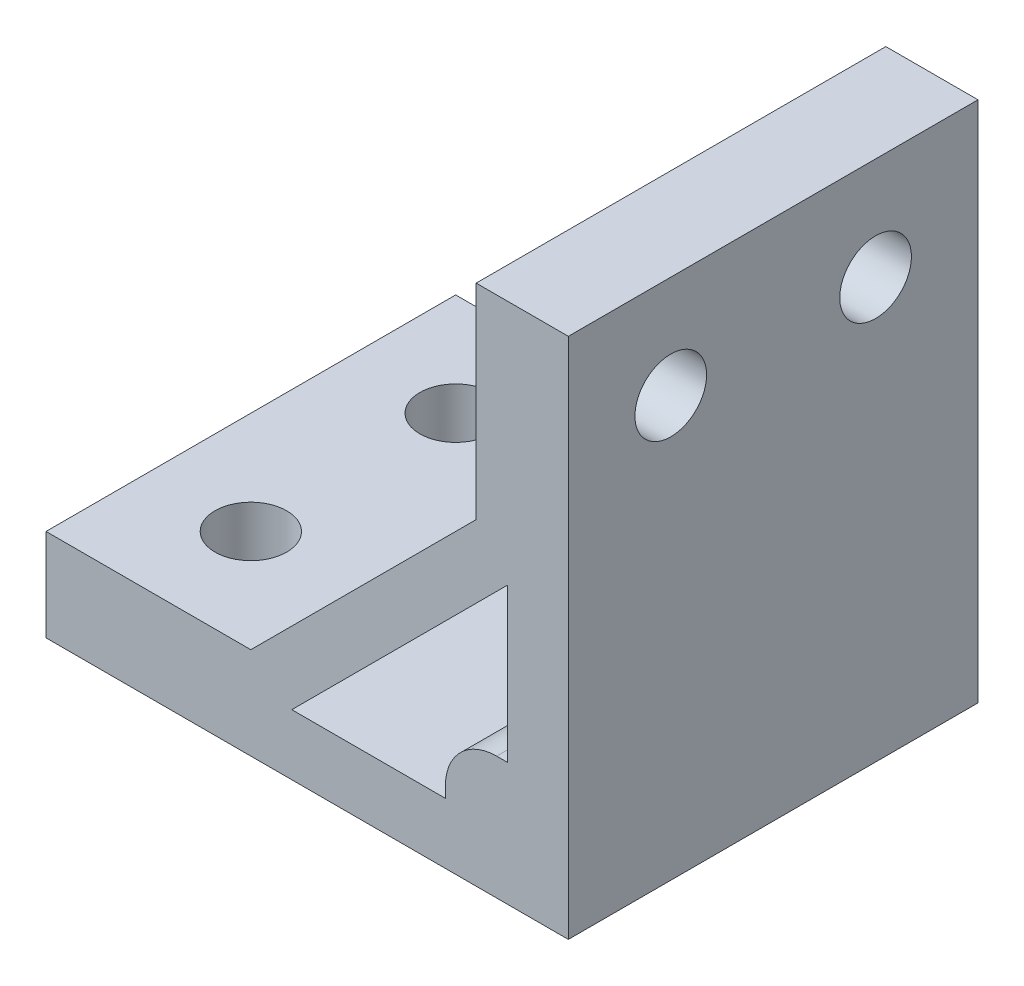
from build123d import *

# Parameters (mm, degrees)
EXTRUDE_1_DEPTH     = 40
FILLET_1_R          = 5
SKETCH_3_R          = 3.5
CUT_EXTRUDE_1_DEPTH = 40
SKETCH_4_R          = 3.5
CUT_EXTRUDE_2_DEPTH = 40


with BuildPart() as part:
    # Sketch 1 → Extrude 1 (new body)
    with BuildSketch(Plane.XY):
        Polygon((0, 0), (0, 51), (-9, 51), (-9, 31), (-31, 9), (-51, 9), (-51, 0), align=None)
        Polygon((-5.928932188, 27), (-27, 5.928932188), (-12, 5.928932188), (-12, 12), (-5.928932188, 12), align=None, mode=Mode.SUBTRACT)
    extrude(amount=EXTRUDE_1_DEPTH)

    # Fillet 1
    fillet_1_edges = [part.edges().sort_by_distance(p)[0] for p in [
        (-12, 12, 20),
    ]]
    fillet(fillet_1_edges, radius=FILLET_1_R)

    # Sketch 3 → Cut-Extrude 1 (cut)
    with BuildSketch(Plane(origin=(0, 0, 0), x_dir=(0, 0, -1), z_dir=(1, 0, 0))):
        with Locations((-10, 41)):
            Circle(SKETCH_3_R)
        with Locations((-30, 41)):
            Circle(SKETCH_3_R)
    extrude(amount=-CUT_EXTRUDE_1_DEPTH, mode=Mode.SUBTRACT)

    # Sketch 4 → Cut-Extrude 2 (cut)
    with BuildSketch(Plane.XZ):
        with Locations(Location((-41, 10, 0), (0, 0, 270))):
            Circle(SKETCH_4_R)
        with Locations(Location((-41, 30, 0), (0, 0, 270))):
            Circle(SKETCH_4_R)
    extrude(amount=-CUT_EXTRUDE_2_DEPTH, mode=Mode.SUBTRACT)


solid = part.part
